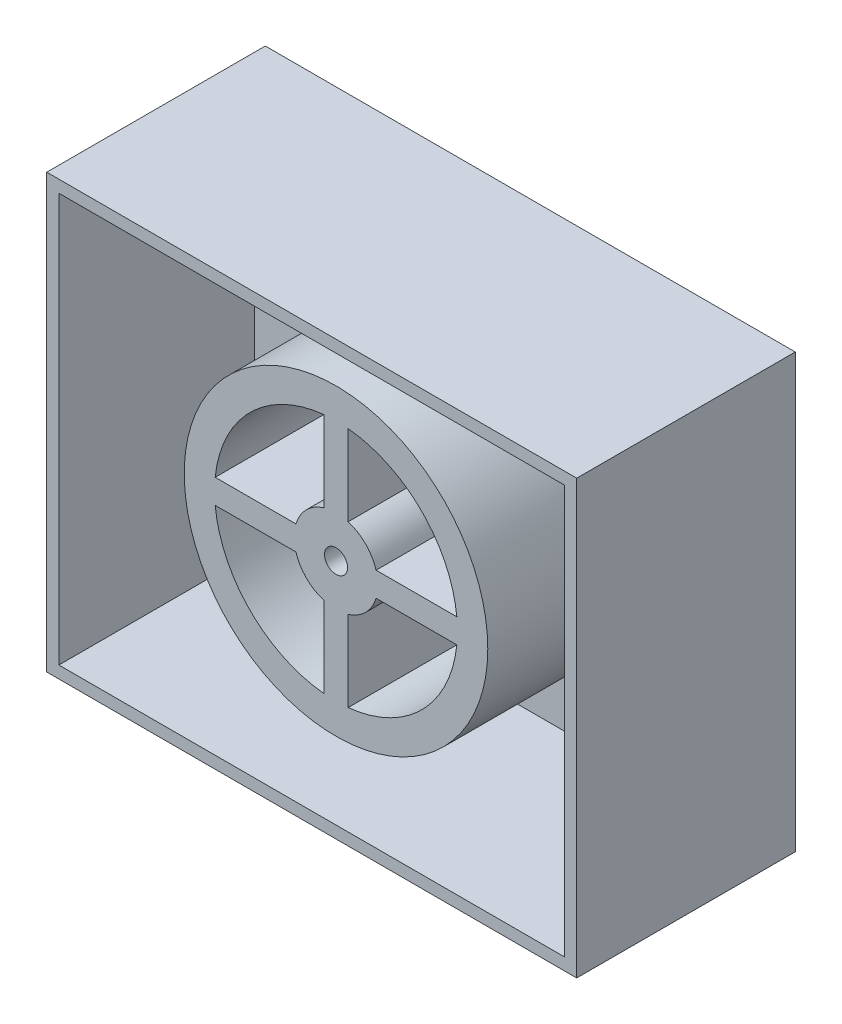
from build123d import *

# Parameters (mm, degrees)
SKETCH1_R           = 25
SKETCH1_R_2         = 1.9
BOSS_EXTRUDE1_DEPTH = 25
SKETCH2_W           = 87.295870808
SKETCH2_H           = 71.305157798
BOSS_EXTRUDE2_DEPTH = 7
SKETCH3_W           = 87.295870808
SKETCH3_H           = 71.305157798
SKETCH3_W_2         = 83.295870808
SKETCH3_H_2         = 67.305157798
BOSS_EXTRUDE3_DEPTH = 29
SKETCH4_W           = 83.295870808
SKETCH4_H           = 67.305157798
SKETCH4_W_2         = 76.895870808
SKETCH4_H_2         = 60.905157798
CUT_EXTRUDE1_DEPTH  = 4


with BuildPart() as part:
    # Sketch1 → Boss-Extrude1 (new body)
    with BuildSketch(Plane.XY):
        with Locations((-10.186001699, 5.215828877)):
            Circle(SKETCH1_R)
        with Locations((-10.186001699, 5.215828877)):
            Circle(SKETCH1_R_2, mode=Mode.SUBTRACT)
        with BuildLine():
            Line((-3.582214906, 3.215828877), (9.713747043, 3.215828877))
            ThreePointArc((9.713747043, 3.215828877), (3.956133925, -8.926306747), (-8.186001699, -14.683919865))
            Line((-8.186001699, -14.683919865), (-8.186001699, -1.387957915))
            ThreePointArc((-8.186001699, -1.387957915), (-5.306964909, 0.336792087), (-3.582214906, 3.215828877))
        make_face(mode=Mode.SUBTRACT)
        with BuildLine():
            Line((-3.582214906, 7.215828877), (9.713747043, 7.215828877))
            ThreePointArc((9.713747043, 7.215828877), (3.956133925, 19.357964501), (-8.186001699, 25.115577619))
            Line((-8.186001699, 25.115577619), (-8.186001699, 11.819615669))
            ThreePointArc((-8.186001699, 11.819615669), (-5.306964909, 10.094865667), (-3.582214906, 7.215828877))
        make_face(mode=Mode.SUBTRACT)
        with BuildLine():
            Line((-12.186001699, -1.387957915), (-12.186001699, -14.683919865))
            ThreePointArc((-12.186001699, -14.683919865), (-24.328137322, -8.926306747), (-30.085750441, 3.215828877))
            Line((-30.085750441, 3.215828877), (-16.789788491, 3.215828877))
            ThreePointArc((-16.789788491, 3.215828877), (-15.065038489, 0.336792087), (-12.186001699, -1.387957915))
        make_face(mode=Mode.SUBTRACT)
        with BuildLine():
            Line((-16.789788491, 7.215828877), (-30.085750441, 7.215828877))
            ThreePointArc((-30.085750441, 7.215828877), (-24.328137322, 19.357964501), (-12.186001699, 25.115577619))
            Line((-12.186001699, 25.115577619), (-12.186001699, 11.819615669))
            ThreePointArc((-12.186001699, 11.819615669), (-15.065038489, 10.094865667), (-16.789788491, 7.215828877))
        make_face(mode=Mode.SUBTRACT)
    extrude(amount=BOSS_EXTRUDE1_DEPTH)

    # Sketch2 → Boss-Extrude2 (add)
    with BuildSketch(Plane(origin=(0, 0, 0), x_dir=(-1, 0, 0), z_dir=(0, 0, -1))):
        with Locations((10.186001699, 5.215828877)):
            Rectangle(SKETCH2_W, SKETCH2_H)
    extrude(amount=BOSS_EXTRUDE2_DEPTH)

    # Sketch3 → Boss-Extrude3 (add)
    with BuildSketch(Plane.XY):
        with Locations((-10.186001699, 5.215828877)):
            Rectangle(SKETCH3_W, SKETCH3_H)
        with Locations((-10.186001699, 5.215828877)):
            Rectangle(SKETCH3_W_2, SKETCH3_H_2, mode=Mode.SUBTRACT)
    extrude(amount=BOSS_EXTRUDE3_DEPTH)

    # Sketch4 → Cut-Extrude1 (cut)
    with BuildSketch(Plane.XY):
        with Locations((-10.186001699, 5.215828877)):
            Rectangle(SKETCH4_W, SKETCH4_H)
        with Locations((-10.186001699, 5.215828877)):
            Rectangle(SKETCH4_W_2, SKETCH4_H_2, mode=Mode.SUBTRACT)
    extrude(amount=-CUT_EXTRUDE1_DEPTH, mode=Mode.SUBTRACT)


solid = part.part
